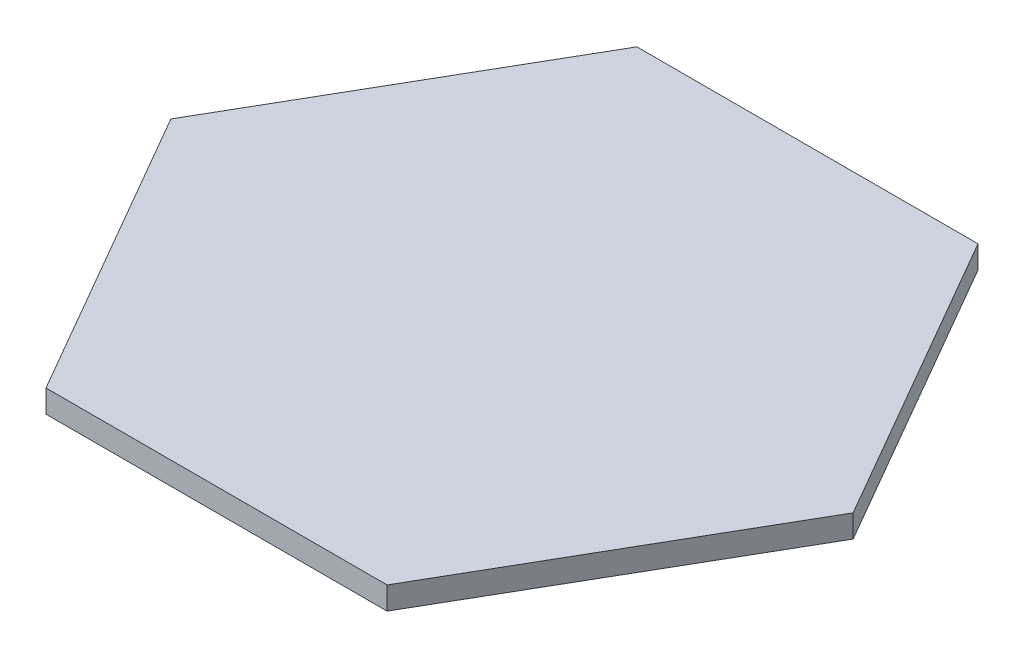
ISO-10303-21;
HEADER;
FILE_DESCRIPTION(('STEP AP214'),'2;1');
FILE_NAME('part.step','',(''),(''),'','','');
FILE_SCHEMA(('AUTOMOTIVE_DESIGN { 1 0 10303 214 1 1 1 1 }'));
ENDSEC;
DATA;
#1=APPLICATION_CONTEXT('core data for automotive mechanical design processes');
#2=APPLICATION_PROTOCOL_DEFINITION('international standard','automotive_design',2000,#1);
#3=PRODUCT_CONTEXT('',#1,'mechanical');
#4=PRODUCT('Part','Part','',(#3));
#5=PRODUCT_RELATED_PRODUCT_CATEGORY('part','',(#4));
#6=PRODUCT_DEFINITION_FORMATION('','',#4);
#7=PRODUCT_DEFINITION_CONTEXT('part definition',#1,'design');
#8=PRODUCT_DEFINITION('design','',#6,#7);
#9=PRODUCT_DEFINITION_SHAPE('','',#8);
#10=(LENGTH_UNIT() NAMED_UNIT(*) SI_UNIT(.MILLI.,.METRE.));
#11=(NAMED_UNIT(*) PLANE_ANGLE_UNIT() SI_UNIT($,.RADIAN.));
#12=(NAMED_UNIT(*) SI_UNIT($,.STERADIAN.) SOLID_ANGLE_UNIT());
#13=UNCERTAINTY_MEASURE_WITH_UNIT(LENGTH_MEASURE(1.E-05),#10,'distance_accuracy_value','');
#14=(GEOMETRIC_REPRESENTATION_CONTEXT(3) GLOBAL_UNCERTAINTY_ASSIGNED_CONTEXT((#13)) GLOBAL_UNIT_ASSIGNED_CONTEXT((#10,
#11,#12)) REPRESENTATION_CONTEXT('',''));
#15=CARTESIAN_POINT('',(0.,0.,0.));
#16=DIRECTION('',(0.,0.,1.));
#17=DIRECTION('',(1.,0.,0.));
#18=AXIS2_PLACEMENT_3D('',#15,#16,#17);
#19=CARTESIAN_POINT('',(27.1819541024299,3.61875921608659,47.0805255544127));
#20=DIRECTION('',(-0.866025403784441,0.,-0.499999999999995));
#21=DIRECTION('',(-0.499999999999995,0.,0.866025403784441));
#22=AXIS2_PLACEMENT_3D('',#19,#20,#21);
#23=PLANE('',#22);
#24=DIRECTION('',(0.499999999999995,0.,-0.866025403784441));
#25=VECTOR('',#24,1.);
#26=CARTESIAN_POINT('',(27.1819541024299,0.,47.0805255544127));
#27=LINE('',#26,#25);
#28=CARTESIAN_POINT('',(27.1819541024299,0.,47.0805255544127));
#29=VERTEX_POINT('',#28);
#30=CARTESIAN_POINT('',(54.3639082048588,0.,0.));
#31=VERTEX_POINT('',#30);
#32=EDGE_CURVE('E116',#29,#31,#27,.T.);
#33=ORIENTED_EDGE('',*,*,#32,.T.);
#34=DIRECTION('',(0.,-1.,0.));
#35=VECTOR('',#34,1.);
#36=CARTESIAN_POINT('',(54.3639082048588,3.61875921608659,0.));
#37=LINE('',#36,#35);
#38=CARTESIAN_POINT('',(54.3639082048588,3.61875921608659,0.));
#39=VERTEX_POINT('',#38);
#40=EDGE_CURVE('E11',#39,#31,#37,.T.);
#41=ORIENTED_EDGE('',*,*,#40,.F.);
#42=DIRECTION('',(0.499999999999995,0.,-0.866025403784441));
#43=VECTOR('',#42,1.);
#44=CARTESIAN_POINT('',(27.1819541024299,3.61875921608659,47.0805255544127));
#45=LINE('',#44,#43);
#46=CARTESIAN_POINT('',(27.1819541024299,3.61875921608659,47.0805255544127));
#47=VERTEX_POINT('',#46);
#48=EDGE_CURVE('E126',#47,#39,#45,.T.);
#49=ORIENTED_EDGE('',*,*,#48,.F.);
#50=DIRECTION('',(0.,-1.,0.));
#51=VECTOR('',#50,1.);
#52=CARTESIAN_POINT('',(27.1819541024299,3.61875921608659,47.0805255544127));
#53=LINE('',#52,#51);
#54=EDGE_CURVE('E112',#47,#29,#53,.T.);
#55=ORIENTED_EDGE('',*,*,#54,.T.);
#56=EDGE_LOOP('',(#33,#41,#49,#55));
#57=FACE_BOUND('',#56,.T.);
#58=ADVANCED_FACE('F32',(#57),#23,.F.);
#59=CARTESIAN_POINT('',(54.3639082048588,3.61875921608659,0.));
#60=DIRECTION('',(-0.866025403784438,0.,0.500000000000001));
#61=DIRECTION('',(0.500000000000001,0.,0.866025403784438));
#62=AXIS2_PLACEMENT_3D('',#59,#60,#61);
#63=PLANE('',#62);
#64=DIRECTION('',(-0.500000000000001,0.,-0.866025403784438));
#65=VECTOR('',#64,1.);
#66=CARTESIAN_POINT('',(54.3639082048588,0.,0.));
#67=LINE('',#66,#65);
#68=CARTESIAN_POINT('',(27.1819541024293,0.,-47.080525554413));
#69=VERTEX_POINT('',#68);
#70=EDGE_CURVE('E119',#31,#69,#67,.T.);
#71=ORIENTED_EDGE('',*,*,#70,.T.);
#72=DIRECTION('',(0.,-1.,0.));
#73=VECTOR('',#72,1.);
#74=CARTESIAN_POINT('',(27.1819541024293,3.61875921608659,-47.080525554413));
#75=LINE('',#74,#73);
#76=CARTESIAN_POINT('',(27.1819541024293,3.61875921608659,-47.080525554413));
#77=VERTEX_POINT('',#76);
#78=EDGE_CURVE('E40',#77,#69,#75,.T.);
#79=ORIENTED_EDGE('',*,*,#78,.F.);
#80=DIRECTION('',(-0.500000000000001,0.,-0.866025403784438));
#81=VECTOR('',#80,1.);
#82=CARTESIAN_POINT('',(54.3639082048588,3.61875921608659,0.));
#83=LINE('',#82,#81);
#84=EDGE_CURVE('E85',#39,#77,#83,.T.);
#85=ORIENTED_EDGE('',*,*,#84,.F.);
#86=ORIENTED_EDGE('',*,*,#40,.T.);
#87=EDGE_LOOP('',(#71,#79,#85,#86));
#88=FACE_BOUND('',#87,.T.);
#89=ADVANCED_FACE('F150',(#88),#63,.F.);
#90=CARTESIAN_POINT('',(27.1819541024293,3.61875921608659,-47.080525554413));
#91=DIRECTION('',(0.,0.,1.));
#92=DIRECTION('',(1.,0.,0.));
#93=AXIS2_PLACEMENT_3D('',#90,#91,#92);
#94=PLANE('',#93);
#95=DIRECTION('',(-1.,0.,0.));
#96=VECTOR('',#95,1.);
#97=CARTESIAN_POINT('',(27.1819541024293,0.,-47.080525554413));
#98=LINE('',#97,#96);
#99=CARTESIAN_POINT('',(-27.1819541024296,0.,-47.0805255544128));
#100=VERTEX_POINT('',#99);
#101=EDGE_CURVE('E121',#69,#100,#98,.T.);
#102=ORIENTED_EDGE('',*,*,#101,.T.);
#103=DIRECTION('',(0.,-1.,0.));
#104=VECTOR('',#103,1.);
#105=CARTESIAN_POINT('',(-27.1819541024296,3.61875921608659,-47.0805255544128));
#106=LINE('',#105,#104);
#107=CARTESIAN_POINT('',(-27.1819541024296,3.61875921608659,-47.0805255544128));
#108=VERTEX_POINT('',#107);
#109=EDGE_CURVE('E107',#108,#100,#106,.T.);
#110=ORIENTED_EDGE('',*,*,#109,.F.);
#111=DIRECTION('',(-1.,0.,0.));
#112=VECTOR('',#111,1.);
#113=CARTESIAN_POINT('',(27.1819541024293,3.61875921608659,-47.080525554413));
#114=LINE('',#113,#112);
#115=EDGE_CURVE('E98',#77,#108,#114,.T.);
#116=ORIENTED_EDGE('',*,*,#115,.F.);
#117=ORIENTED_EDGE('',*,*,#78,.T.);
#118=EDGE_LOOP('',(#102,#110,#116,#117));
#119=FACE_BOUND('',#118,.T.);
#120=ADVANCED_FACE('F132',(#119),#94,.F.);
#121=CARTESIAN_POINT('',(-27.1819541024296,3.61875921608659,-47.0805255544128));
#122=DIRECTION('',(0.866025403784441,0.,0.499999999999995));
#123=DIRECTION('',(0.499999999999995,0.,-0.866025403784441));
#124=AXIS2_PLACEMENT_3D('',#121,#122,#123);
#125=PLANE('',#124);
#126=DIRECTION('',(-0.499999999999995,0.,0.866025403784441));
#127=VECTOR('',#126,1.);
#128=CARTESIAN_POINT('',(-27.1819541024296,0.,-47.0805255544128));
#129=LINE('',#128,#127);
#130=CARTESIAN_POINT('',(-54.3639082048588,0.,3.72682467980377E-13));
#131=VERTEX_POINT('',#130);
#132=EDGE_CURVE('E106',#100,#131,#129,.T.);
#133=ORIENTED_EDGE('',*,*,#132,.T.);
#134=DIRECTION('',(0.,-1.,0.));
#135=VECTOR('',#134,1.);
#136=CARTESIAN_POINT('',(-54.3639082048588,3.61875921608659,3.72682467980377E-13));
#137=LINE('',#136,#135);
#138=CARTESIAN_POINT('',(-54.3639082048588,3.61875921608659,3.72682467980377E-13));
#139=VERTEX_POINT('',#138);
#140=EDGE_CURVE('E103',#139,#131,#137,.T.);
#141=ORIENTED_EDGE('',*,*,#140,.F.);
#142=DIRECTION('',(-0.499999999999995,0.,0.866025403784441));
#143=VECTOR('',#142,1.);
#144=CARTESIAN_POINT('',(-27.1819541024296,3.61875921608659,-47.0805255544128));
#145=LINE('',#144,#143);
#146=EDGE_CURVE('E92',#108,#139,#145,.T.);
#147=ORIENTED_EDGE('',*,*,#146,.F.);
#148=ORIENTED_EDGE('',*,*,#109,.T.);
#149=EDGE_LOOP('',(#133,#141,#147,#148));
#150=FACE_BOUND('',#149,.T.);
#151=ADVANCED_FACE('F104',(#150),#125,.F.);
#152=CARTESIAN_POINT('',(-54.3639082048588,3.61875921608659,3.72682467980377E-13));
#153=DIRECTION('',(0.866025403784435,0.,-0.500000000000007));
#154=DIRECTION('',(-0.500000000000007,0.,-0.866025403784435));
#155=AXIS2_PLACEMENT_3D('',#152,#153,#154);
#156=PLANE('',#155);
#157=DIRECTION('',(0.500000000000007,0.,0.866025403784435));
#158=VECTOR('',#157,1.);
#159=CARTESIAN_POINT('',(-54.3639082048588,0.,3.72682467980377E-13));
#160=LINE('',#159,#158);
#161=CARTESIAN_POINT('',(-27.1819541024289,0.,47.0805255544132));
#162=VERTEX_POINT('',#161);
#163=EDGE_CURVE('E71',#131,#162,#160,.T.);
#164=ORIENTED_EDGE('',*,*,#163,.T.);
#165=DIRECTION('',(0.,-1.,0.));
#166=VECTOR('',#165,1.);
#167=CARTESIAN_POINT('',(-27.1819541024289,3.61875921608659,47.0805255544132));
#168=LINE('',#167,#166);
#169=CARTESIAN_POINT('',(-27.1819541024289,3.61875921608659,47.0805255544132));
#170=VERTEX_POINT('',#169);
#171=EDGE_CURVE('E108',#170,#162,#168,.T.);
#172=ORIENTED_EDGE('',*,*,#171,.F.);
#173=DIRECTION('',(0.500000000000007,0.,0.866025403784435));
#174=VECTOR('',#173,1.);
#175=CARTESIAN_POINT('',(-54.3639082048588,3.61875921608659,3.72682467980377E-13));
#176=LINE('',#175,#174);
#177=EDGE_CURVE('E96',#139,#170,#176,.T.);
#178=ORIENTED_EDGE('',*,*,#177,.F.);
#179=ORIENTED_EDGE('',*,*,#140,.T.);
#180=EDGE_LOOP('',(#164,#172,#178,#179));
#181=FACE_BOUND('',#180,.T.);
#182=ADVANCED_FACE('F110',(#181),#156,.F.);
#183=CARTESIAN_POINT('',(-27.1819541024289,3.61875921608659,47.0805255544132));
#184=DIRECTION('',(0.,0.,-1.));
#185=DIRECTION('',(-1.,0.,0.));
#186=AXIS2_PLACEMENT_3D('',#183,#184,#185);
#187=PLANE('',#186);
#188=DIRECTION('',(1.,0.,0.));
#189=VECTOR('',#188,1.);
#190=CARTESIAN_POINT('',(-27.1819541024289,0.,47.0805255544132));
#191=LINE('',#190,#189);
#192=EDGE_CURVE('E77',#162,#29,#191,.T.);
#193=ORIENTED_EDGE('',*,*,#192,.T.);
#194=ORIENTED_EDGE('',*,*,#54,.F.);
#195=DIRECTION('',(1.,0.,0.));
#196=VECTOR('',#195,1.);
#197=CARTESIAN_POINT('',(-27.1819541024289,3.61875921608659,47.0805255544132));
#198=LINE('',#197,#196);
#199=EDGE_CURVE('E48',#170,#47,#198,.T.);
#200=ORIENTED_EDGE('',*,*,#199,.F.);
#201=ORIENTED_EDGE('',*,*,#171,.T.);
#202=EDGE_LOOP('',(#193,#194,#200,#201));
#203=FACE_BOUND('',#202,.T.);
#204=ADVANCED_FACE('F139',(#203),#187,.F.);
#205=CARTESIAN_POINT('',(81.5458623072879,3.61875921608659,-47.0805255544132));
#206=DIRECTION('',(0.,1.,0.));
#207=DIRECTION('',(0.,0.,1.));
#208=AXIS2_PLACEMENT_3D('',#205,#206,#207);
#209=PLANE('',#208);
#210=ORIENTED_EDGE('',*,*,#48,.T.);
#211=ORIENTED_EDGE('',*,*,#84,.T.);
#212=ORIENTED_EDGE('',*,*,#115,.T.);
#213=ORIENTED_EDGE('',*,*,#146,.T.);
#214=ORIENTED_EDGE('',*,*,#177,.T.);
#215=ORIENTED_EDGE('',*,*,#199,.T.);
#216=EDGE_LOOP('',(#210,#211,#212,#213,#214,#215));
#217=FACE_BOUND('',#216,.T.);
#218=ADVANCED_FACE('F94',(#217),#209,.T.);
#219=CARTESIAN_POINT('',(81.5458623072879,0.,-47.0805255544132));
#220=DIRECTION('',(0.,1.,0.));
#221=DIRECTION('',(0.,0.,1.));
#222=AXIS2_PLACEMENT_3D('',#219,#220,#221);
#223=PLANE('',#222);
#224=ORIENTED_EDGE('',*,*,#32,.F.);
#225=ORIENTED_EDGE('',*,*,#192,.F.);
#226=ORIENTED_EDGE('',*,*,#163,.F.);
#227=ORIENTED_EDGE('',*,*,#132,.F.);
#228=ORIENTED_EDGE('',*,*,#101,.F.);
#229=ORIENTED_EDGE('',*,*,#70,.F.);
#230=EDGE_LOOP('',(#224,#225,#226,#227,#228,#229));
#231=FACE_BOUND('',#230,.T.);
#232=ADVANCED_FACE('F135',(#231),#223,.F.);
#233=CLOSED_SHELL('',(#58,#89,#120,#151,#182,#204,#218,#232));
#234=MANIFOLD_SOLID_BREP('B2',#233);
#235=ADVANCED_BREP_SHAPE_REPRESENTATION('',(#18,#234),#14);
#236=SHAPE_DEFINITION_REPRESENTATION(#9,#235);
ENDSEC;
END-ISO-10303-21;
